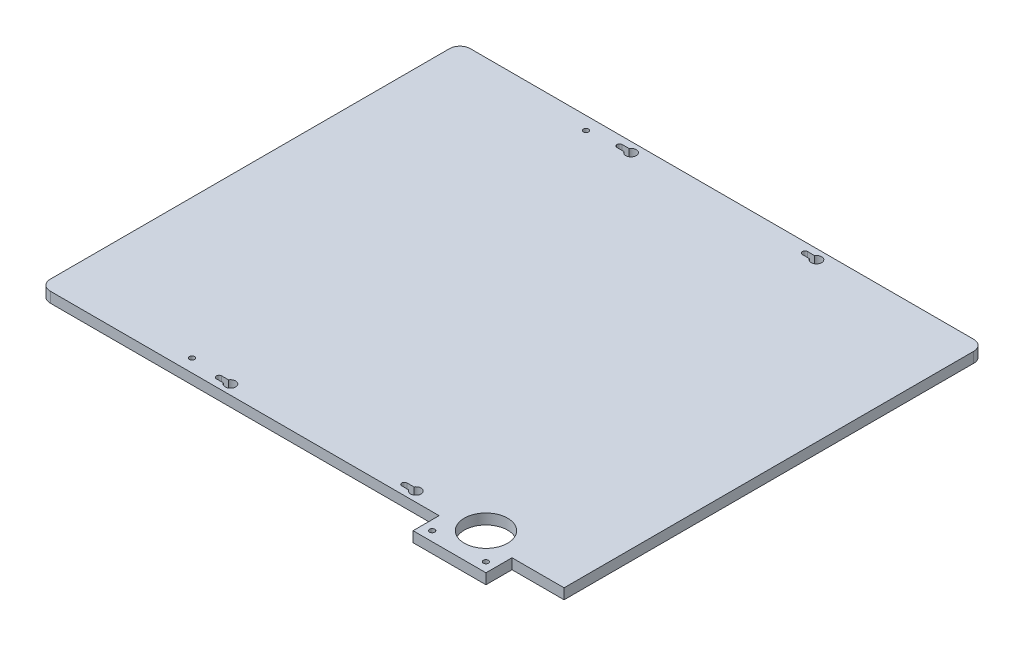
from build123d import *

# Parameters (mm, degrees)
SKETCH1_R           = 12.5
SKETCH1_R_2         = 1.5
BOSS_EXTRUDE1_DEPTH = 6
CUT_EXTRUDE1_DEPTH  = 204.305189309
CUT_EXTRUDE2_DEPTH  = 204.305189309
CUT_EXTRUDE3_DEPTH  = 204.305189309
CUT_EXTRUDE4_DEPTH  = 204.305189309
SKETCH6_W           = 3
SKETCH6_H           = 6
SKETCH7_W           = 3
SKETCH7_H           = 6
SKETCH8_W           = 3
SKETCH8_H           = 6
SKETCH9_W           = 3
SKETCH9_H           = 6
FILLET1_R           = 6


with BuildPart() as part:
    # Sketch1 → Boss-Extrude1 (new body)
    with BuildSketch(Plane(origin=(0, 3, 0), x_dir=(1, 0, 0), z_dir=(0, 1, 0))):
        Polygon((-151, 121), (-151, -121), (79, -121), (79, -136), (121, -136), (121, -121), (151, -121), (151, 121), align=None)
        with Locations(Location((100, -115, 0), (0, 0, 270))):
            Circle(SKETCH1_R, mode=Mode.SUBTRACT)
        with Locations(Location((-70.85, -113.5, 0), (0, 0, 270))):
            Circle(SKETCH1_R_2, mode=Mode.SUBTRACT)
        with Locations(Location((-70.85, 113.5, 0), (0, 0, 270))):
            Circle(SKETCH1_R_2, mode=Mode.SUBTRACT)
        with Locations(Location((115.5, -130.5, 0), (0, 0, 270))):
            Circle(SKETCH1_R_2, mode=Mode.SUBTRACT)
        with Locations(Location((84.5, -130.5, 0), (0, 0, 270))):
            Circle(SKETCH1_R_2, mode=Mode.SUBTRACT)
    extrude(amount=-BOSS_EXTRUDE1_DEPTH)

    # Sketch2 → Cut-Extrude1 (cut, through all)
    with BuildSketch(Plane(origin=(0, -3, 0), x_dir=(-1, 0, 0), z_dir=(0, 1, 0))):
        with BuildLine():
            Line((-57.401923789, -116.9), (-53.4, -116.9))
            ThreePointArc((-53.4, -116.9), (-51.9, -115.4), (-53.4, -113.9))
            Line((-53.4, -113.9), (-57.401923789, -113.9))
            ThreePointArc((-57.401923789, -113.9), (-57, -115.4), (-57.401923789, -116.9))
        make_face()
    extrude(amount=CUT_EXTRUDE1_DEPTH, mode=Mode.SUBTRACT)

    # Sketch3 → Cut-Extrude2 (cut, through all)
    with BuildSketch(Plane(origin=(0, -3, 0), x_dir=(-1, 0, 0), z_dir=(0, 1, 0))):
        with BuildLine():
            Line((49.398076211, -116.9), (53.4, -116.9))
            ThreePointArc((53.4, -116.9), (54.9, -115.4), (53.4, -113.9))
            Line((53.4, -113.9), (49.398076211, -113.9))
            ThreePointArc((49.398076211, -113.9), (49.8, -115.4), (49.398076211, -116.9))
        make_face()
    extrude(amount=CUT_EXTRUDE2_DEPTH, mode=Mode.SUBTRACT)

    # Sketch4 → Cut-Extrude3 (cut, through all)
    with BuildSketch(Plane(origin=(0, -3, 0), x_dir=(-1, 0, 0), z_dir=(0, 1, 0))):
        with BuildLine():
            Line((-57.401923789, 113.9), (-53.4, 113.9))
            ThreePointArc((-53.4, 113.9), (-51.9, 115.4), (-53.4, 116.9))
            Line((-53.4, 116.9), (-57.401923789, 116.9))
            ThreePointArc((-57.401923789, 116.9), (-57, 115.4), (-57.401923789, 113.9))
        make_face()
    extrude(amount=CUT_EXTRUDE3_DEPTH, mode=Mode.SUBTRACT)

    # Sketch5 → Cut-Extrude4 (cut, through all)
    with BuildSketch(Plane.XZ.offset(-3)):
        with BuildLine():
            Line((-53.4, 113.9), (-49.398076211, 113.9))
            ThreePointArc((-49.398076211, 113.9), (-49.8, 115.4), (-49.398076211, 116.9))
            Line((-49.398076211, 116.9), (-53.4, 116.9))
            ThreePointArc((-53.4, 116.9), (-54.9, 115.4), (-53.4, 113.9))
        make_face()
    extrude(amount=CUT_EXTRUDE4_DEPTH, mode=Mode.SUBTRACT)

    # Sketch6 → Cut-Revolve1 (revolve, cut)
    with BuildSketch(Plane.XY.offset(-115.4)):
        with Locations((61.5, 0)):
            Rectangle(SKETCH6_W, SKETCH6_H)
    revolve(axis=Axis((60, 3, -115.4), (0, -1, 0)), mode=Mode.SUBTRACT)

    # Sketch7 → Cut-Revolve2 (revolve, cut)
    with BuildSketch(Plane.XY.offset(-115.4)):
        with Locations((-45.3, 0)):
            Rectangle(SKETCH7_W, SKETCH7_H)
    revolve(axis=Axis((-46.8, 3, -115.4), (0, -1, 0)), mode=Mode.SUBTRACT)

    # Sketch8 → Cut-Revolve3 (revolve, cut)
    with BuildSketch(Plane.XY.offset(115.4)):
        with Locations((61.5, 0)):
            Rectangle(SKETCH8_W, SKETCH8_H)
    revolve(axis=Axis((60, 3, 115.4), (0, -1, 0)), mode=Mode.SUBTRACT)

    # Sketch9 → Cut-Revolve4 (revolve, cut)
    with BuildSketch(Plane.XY.offset(115.4)):
        with Locations((-45.3, 0)):
            Rectangle(SKETCH9_W, SKETCH9_H)
    revolve(axis=Axis((-46.8, 3, 115.4), (0, -1, 0)), mode=Mode.SUBTRACT)

    # Fillet1
    fillet1_edges = [part.edges().sort_by_distance(p)[0] for p in [
        (-151, 0, 121),
        (-151, 0, -121),
        (151, 0, -121),
    ]]
    fillet(fillet1_edges, radius=FILLET1_R)


solid = part.part
